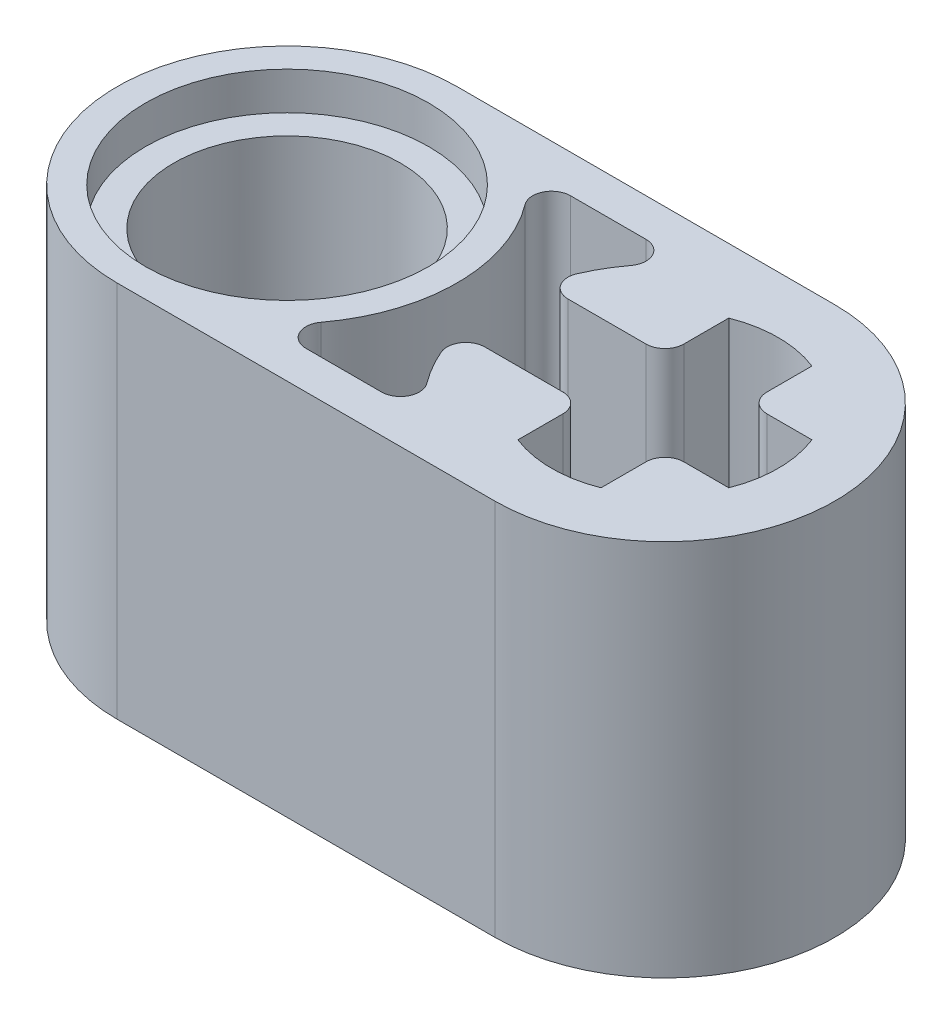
ISO-10303-21;
HEADER;
FILE_DESCRIPTION(('STEP AP214'),'2;1');
FILE_NAME('part.step','',(''),(''),'','','');
FILE_SCHEMA(('AUTOMOTIVE_DESIGN { 1 0 10303 214 1 1 1 1 }'));
ENDSEC;
DATA;
#1=APPLICATION_CONTEXT('core data for automotive mechanical design processes');
#2=APPLICATION_PROTOCOL_DEFINITION('international standard','automotive_design',2000,#1);
#3=PRODUCT_CONTEXT('',#1,'mechanical');
#4=PRODUCT('Part','Part','',(#3));
#5=PRODUCT_RELATED_PRODUCT_CATEGORY('part','',(#4));
#6=PRODUCT_DEFINITION_FORMATION('','',#4);
#7=PRODUCT_DEFINITION_CONTEXT('part definition',#1,'design');
#8=PRODUCT_DEFINITION('design','',#6,#7);
#9=PRODUCT_DEFINITION_SHAPE('','',#8);
#10=(LENGTH_UNIT() NAMED_UNIT(*) SI_UNIT(.MILLI.,.METRE.));
#11=(NAMED_UNIT(*) PLANE_ANGLE_UNIT() SI_UNIT($,.RADIAN.));
#12=(NAMED_UNIT(*) SI_UNIT($,.STERADIAN.) SOLID_ANGLE_UNIT());
#13=UNCERTAINTY_MEASURE_WITH_UNIT(LENGTH_MEASURE(1.E-05),#10,'distance_accuracy_value','');
#14=(GEOMETRIC_REPRESENTATION_CONTEXT(3) GLOBAL_UNCERTAINTY_ASSIGNED_CONTEXT((#13)) GLOBAL_UNIT_ASSIGNED_CONTEXT((#10,
#11,#12)) REPRESENTATION_CONTEXT('',''));
#15=CARTESIAN_POINT('',(0.,0.,0.));
#16=DIRECTION('',(0.,0.,1.));
#17=DIRECTION('',(1.,0.,0.));
#18=AXIS2_PLACEMENT_3D('',#15,#16,#17);
#19=CARTESIAN_POINT('',(-4.,8.,0.));
#20=DIRECTION('',(0.,-1.,0.));
#21=DIRECTION('',(0.,0.,-1.));
#22=AXIS2_PLACEMENT_3D('',#19,#20,#21);
#23=CYLINDRICAL_SURFACE('',#22,2.4);
#24=CARTESIAN_POINT('',(-4.,7.2,0.));
#25=DIRECTION('',(0.,1.,0.));
#26=DIRECTION('',(0.,0.,1.));
#27=AXIS2_PLACEMENT_3D('',#24,#25,#26);
#28=CIRCLE('',#27,2.4);
#29=CARTESIAN_POINT('',(-4.,7.2,2.4));
#30=VERTEX_POINT('',#29);
#31=EDGE_CURVE('E340',#30,#30,#28,.T.);
#32=ORIENTED_EDGE('',*,*,#31,.T.);
#33=EDGE_LOOP('',(#32));
#34=FACE_BOUND('',#33,.T.);
#35=CARTESIAN_POINT('',(-4.,0.8,0.));
#36=DIRECTION('',(0.,-1.,0.));
#37=DIRECTION('',(0.,0.,-1.));
#38=AXIS2_PLACEMENT_3D('',#35,#36,#37);
#39=CIRCLE('',#38,2.4);
#40=CARTESIAN_POINT('',(-4.,0.8,-2.4));
#41=VERTEX_POINT('',#40);
#42=EDGE_CURVE('E42',#41,#41,#39,.T.);
#43=ORIENTED_EDGE('',*,*,#42,.T.);
#44=EDGE_LOOP('',(#43));
#45=FACE_BOUND('',#44,.T.);
#46=ADVANCED_FACE('F38',(#34,#45),#23,.F.);
#47=CARTESIAN_POINT('',(-4.,8.,0.));
#48=DIRECTION('',(0.,1.,0.));
#49=DIRECTION('',(0.,0.,1.));
#50=AXIS2_PLACEMENT_3D('',#47,#48,#49);
#51=PLANE('',#50);
#52=CARTESIAN_POINT('',(-4.,8.,0.));
#53=DIRECTION('',(0.,1.,0.));
#54=DIRECTION('',(0.,0.,1.));
#55=AXIS2_PLACEMENT_3D('',#52,#53,#54);
#56=CIRCLE('',#55,3.);
#57=CARTESIAN_POINT('',(-4.,8.,3.));
#58=VERTEX_POINT('',#57);
#59=EDGE_CURVE('E554',#58,#58,#56,.T.);
#60=ORIENTED_EDGE('',*,*,#59,.F.);
#61=EDGE_LOOP('',(#60));
#62=FACE_BOUND('',#61,.T.);
#63=CARTESIAN_POINT('',(-4.,8.,0.));
#64=DIRECTION('',(0.,1.,0.));
#65=DIRECTION('',(0.,0.,1.));
#66=AXIS2_PLACEMENT_3D('',#63,#64,#65);
#67=CIRCLE('',#66,3.6);
#68=CARTESIAN_POINT('',(-4.,8.,-3.6));
#69=VERTEX_POINT('',#68);
#70=CARTESIAN_POINT('',(-4.,8.,3.6));
#71=VERTEX_POINT('',#70);
#72=EDGE_CURVE('E512',#69,#71,#67,.T.);
#73=ORIENTED_EDGE('',*,*,#72,.T.);
#74=DIRECTION('',(1.,0.,0.));
#75=VECTOR('',#74,1.);
#76=CARTESIAN_POINT('',(-4.,8.,3.6));
#77=LINE('',#76,#75);
#78=CARTESIAN_POINT('',(4.,8.,3.6));
#79=VERTEX_POINT('',#78);
#80=EDGE_CURVE('E516',#71,#79,#77,.T.);
#81=ORIENTED_EDGE('',*,*,#80,.T.);
#82=CARTESIAN_POINT('',(4.,8.,0.));
#83=DIRECTION('',(0.,1.,0.));
#84=DIRECTION('',(0.,0.,1.));
#85=AXIS2_PLACEMENT_3D('',#82,#83,#84);
#86=CIRCLE('',#85,3.6);
#87=CARTESIAN_POINT('',(4.,8.,-3.6));
#88=VERTEX_POINT('',#87);
#89=EDGE_CURVE('E520',#79,#88,#86,.T.);
#90=ORIENTED_EDGE('',*,*,#89,.T.);
#91=DIRECTION('',(-1.,0.,0.));
#92=VECTOR('',#91,1.);
#93=CARTESIAN_POINT('',(-4.,8.,-3.6));
#94=LINE('',#93,#92);
#95=EDGE_CURVE('E523',#88,#69,#94,.T.);
#96=ORIENTED_EDGE('',*,*,#95,.T.);
#97=EDGE_LOOP('',(#73,#81,#90,#96));
#98=FACE_BOUND('',#97,.T.);
#99=DIRECTION('',(0.,0.,1.));
#100=VECTOR('',#99,1.);
#101=CARTESIAN_POINT('',(3.12,8.,-2.23284571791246));
#102=LINE('',#101,#100);
#103=CARTESIAN_POINT('',(3.12,8.,-2.23284571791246));
#104=VERTEX_POINT('',#103);
#105=CARTESIAN_POINT('',(3.12,8.,-1.28));
#106=VERTEX_POINT('',#105);
#107=EDGE_CURVE('E247',#104,#106,#102,.T.);
#108=ORIENTED_EDGE('',*,*,#107,.F.);
#109=CARTESIAN_POINT('',(4.,8.,0.));
#110=DIRECTION('',(0.,1.,0.));
#111=DIRECTION('',(0.,0.,1.));
#112=AXIS2_PLACEMENT_3D('',#109,#110,#111);
#113=CIRCLE('',#112,2.4);
#114=CARTESIAN_POINT('',(4.88,8.,-2.23284571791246));
#115=VERTEX_POINT('',#114);
#116=EDGE_CURVE('E238',#115,#104,#113,.T.);
#117=ORIENTED_EDGE('',*,*,#116,.F.);
#118=DIRECTION('',(0.,0.,-1.));
#119=VECTOR('',#118,1.);
#120=CARTESIAN_POINT('',(4.88,8.,-1.28));
#121=LINE('',#120,#119);
#122=CARTESIAN_POINT('',(4.88,8.,-1.28));
#123=VERTEX_POINT('',#122);
#124=EDGE_CURVE('E335',#123,#115,#121,.T.);
#125=ORIENTED_EDGE('',*,*,#124,.F.);
#126=CARTESIAN_POINT('',(5.28,8.,-1.28));
#127=DIRECTION('',(0.,-1.,0.));
#128=DIRECTION('',(0.,0.,-1.));
#129=AXIS2_PLACEMENT_3D('',#126,#127,#128);
#130=CIRCLE('',#129,0.4);
#131=CARTESIAN_POINT('',(5.28,8.,-0.88));
#132=VERTEX_POINT('',#131);
#133=EDGE_CURVE('E332',#132,#123,#130,.T.);
#134=ORIENTED_EDGE('',*,*,#133,.F.);
#135=DIRECTION('',(-1.,0.,0.));
#136=VECTOR('',#135,1.);
#137=CARTESIAN_POINT('',(6.23284571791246,8.,-0.880000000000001));
#138=LINE('',#137,#136);
#139=CARTESIAN_POINT('',(6.23284571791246,8.,-0.880000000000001));
#140=VERTEX_POINT('',#139);
#141=EDGE_CURVE('E329',#140,#132,#138,.T.);
#142=ORIENTED_EDGE('',*,*,#141,.F.);
#143=CARTESIAN_POINT('',(4.,8.,0.));
#144=DIRECTION('',(0.,1.,0.));
#145=DIRECTION('',(0.,0.,1.));
#146=AXIS2_PLACEMENT_3D('',#143,#144,#145);
#147=CIRCLE('',#146,2.4);
#148=CARTESIAN_POINT('',(6.23284571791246,8.,0.88));
#149=VERTEX_POINT('',#148);
#150=EDGE_CURVE('E326',#149,#140,#147,.T.);
#151=ORIENTED_EDGE('',*,*,#150,.F.);
#152=DIRECTION('',(1.,0.,0.));
#153=VECTOR('',#152,1.);
#154=CARTESIAN_POINT('',(5.28,8.,0.88));
#155=LINE('',#154,#153);
#156=CARTESIAN_POINT('',(5.28,8.,0.88));
#157=VERTEX_POINT('',#156);
#158=EDGE_CURVE('E323',#157,#149,#155,.T.);
#159=ORIENTED_EDGE('',*,*,#158,.F.);
#160=CARTESIAN_POINT('',(5.28,8.,1.28));
#161=DIRECTION('',(0.,-1.,0.));
#162=DIRECTION('',(0.,0.,1.));
#163=AXIS2_PLACEMENT_3D('',#160,#161,#162);
#164=CIRCLE('',#163,0.400000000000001);
#165=CARTESIAN_POINT('',(4.88,8.,1.28));
#166=VERTEX_POINT('',#165);
#167=EDGE_CURVE('E320',#166,#157,#164,.T.);
#168=ORIENTED_EDGE('',*,*,#167,.F.);
#169=DIRECTION('',(0.,0.,-1.));
#170=VECTOR('',#169,1.);
#171=CARTESIAN_POINT('',(4.88,8.,2.23284571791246));
#172=LINE('',#171,#170);
#173=CARTESIAN_POINT('',(4.88,8.,2.23284571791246));
#174=VERTEX_POINT('',#173);
#175=EDGE_CURVE('E317',#174,#166,#172,.T.);
#176=ORIENTED_EDGE('',*,*,#175,.F.);
#177=CARTESIAN_POINT('',(4.,8.,0.));
#178=DIRECTION('',(0.,1.,0.));
#179=DIRECTION('',(0.,0.,1.));
#180=AXIS2_PLACEMENT_3D('',#177,#178,#179);
#181=CIRCLE('',#180,2.4);
#182=CARTESIAN_POINT('',(3.12,8.,2.23284571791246));
#183=VERTEX_POINT('',#182);
#184=EDGE_CURVE('E314',#183,#174,#181,.T.);
#185=ORIENTED_EDGE('',*,*,#184,.F.);
#186=DIRECTION('',(0.,0.,1.));
#187=VECTOR('',#186,1.);
#188=CARTESIAN_POINT('',(3.12,8.,1.28));
#189=LINE('',#188,#187);
#190=CARTESIAN_POINT('',(3.12,8.,1.28));
#191=VERTEX_POINT('',#190);
#192=EDGE_CURVE('E311',#191,#183,#189,.T.);
#193=ORIENTED_EDGE('',*,*,#192,.F.);
#194=CARTESIAN_POINT('',(2.72,8.,1.28));
#195=DIRECTION('',(0.,-1.,0.));
#196=DIRECTION('',(0.,0.,-1.));
#197=AXIS2_PLACEMENT_3D('',#194,#195,#196);
#198=CIRCLE('',#197,0.4);
#199=CARTESIAN_POINT('',(2.72,8.,0.88));
#200=VERTEX_POINT('',#199);
#201=EDGE_CURVE('E308',#200,#191,#198,.T.);
#202=ORIENTED_EDGE('',*,*,#201,.F.);
#203=DIRECTION('',(1.,0.,0.));
#204=VECTOR('',#203,1.);
#205=CARTESIAN_POINT('',(1.76715428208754,8.,0.88));
#206=LINE('',#205,#204);
#207=CARTESIAN_POINT('',(1.06715155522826,8.,0.88));
#208=VERTEX_POINT('',#207);
#209=EDGE_CURVE('E305',#208,#200,#206,.T.);
#210=ORIENTED_EDGE('',*,*,#209,.F.);
#211=CARTESIAN_POINT('',(1.06715155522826,8.,1.28));
#212=DIRECTION('',(0.,-1.,0.));
#213=DIRECTION('',(0.,0.,1.));
#214=AXIS2_PLACEMENT_3D('',#211,#212,#213);
#215=CIRCLE('',#214,0.400000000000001);
#216=CARTESIAN_POINT('',(0.700545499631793,8.,1.44));
#217=VERTEX_POINT('',#216);
#218=EDGE_CURVE('E302',#217,#208,#215,.T.);
#219=ORIENTED_EDGE('',*,*,#218,.F.);
#220=CARTESIAN_POINT('',(4.,8.,0.));
#221=DIRECTION('',(0.,-1.,0.));
#222=DIRECTION('',(0.,0.,1.));
#223=AXIS2_PLACEMENT_3D('',#220,#221,#222);
#224=CIRCLE('',#223,3.6);
#225=CARTESIAN_POINT('',(1.12,8.,2.16));
#226=VERTEX_POINT('',#225);
#227=EDGE_CURVE('E299',#226,#217,#224,.T.);
#228=ORIENTED_EDGE('',*,*,#227,.F.);
#229=CARTESIAN_POINT('',(0.799999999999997,8.,2.4));
#230=DIRECTION('',(0.,1.,0.));
#231=DIRECTION('',(0.,0.,1.));
#232=AXIS2_PLACEMENT_3D('',#229,#230,#231);
#233=CIRCLE('',#232,0.4);
#234=CARTESIAN_POINT('',(0.799999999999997,8.,2.8));
#235=VERTEX_POINT('',#234);
#236=EDGE_CURVE('E296',#235,#226,#233,.T.);
#237=ORIENTED_EDGE('',*,*,#236,.F.);
#238=DIRECTION('',(1.,0.,0.));
#239=VECTOR('',#238,1.);
#240=CARTESIAN_POINT('',(-0.8,8.,2.8));
#241=LINE('',#240,#239);
#242=CARTESIAN_POINT('',(-0.8,8.,2.8));
#243=VERTEX_POINT('',#242);
#244=EDGE_CURVE('E293',#243,#235,#241,.T.);
#245=ORIENTED_EDGE('',*,*,#244,.F.);
#246=CARTESIAN_POINT('',(-0.8,8.,2.4));
#247=DIRECTION('',(0.,1.,0.));
#248=DIRECTION('',(0.,0.,-1.));
#249=AXIS2_PLACEMENT_3D('',#246,#247,#248);
#250=CIRCLE('',#249,0.4);
#251=CARTESIAN_POINT('',(-1.12,8.,2.16));
#252=VERTEX_POINT('',#251);
#253=EDGE_CURVE('E290',#252,#243,#250,.T.);
#254=ORIENTED_EDGE('',*,*,#253,.F.);
#255=CARTESIAN_POINT('',(-4.,8.,0.));
#256=DIRECTION('',(0.,-1.,0.));
#257=DIRECTION('',(0.,0.,1.));
#258=AXIS2_PLACEMENT_3D('',#255,#256,#257);
#259=CIRCLE('',#258,3.6);
#260=CARTESIAN_POINT('',(-1.12,8.,-2.16));
#261=VERTEX_POINT('',#260);
#262=EDGE_CURVE('E287',#261,#252,#259,.T.);
#263=ORIENTED_EDGE('',*,*,#262,.F.);
#264=CARTESIAN_POINT('',(-0.8,8.,-2.4));
#265=DIRECTION('',(0.,1.,0.));
#266=DIRECTION('',(0.,0.,1.));
#267=AXIS2_PLACEMENT_3D('',#264,#265,#266);
#268=CIRCLE('',#267,0.4);
#269=CARTESIAN_POINT('',(-0.8,8.,-2.8));
#270=VERTEX_POINT('',#269);
#271=EDGE_CURVE('E284',#270,#261,#268,.T.);
#272=ORIENTED_EDGE('',*,*,#271,.F.);
#273=DIRECTION('',(-1.,0.,0.));
#274=VECTOR('',#273,1.);
#275=CARTESIAN_POINT('',(-0.8,8.,-2.8));
#276=LINE('',#275,#274);
#277=CARTESIAN_POINT('',(0.799999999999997,8.,-2.8));
#278=VERTEX_POINT('',#277);
#279=EDGE_CURVE('E281',#278,#270,#276,.T.);
#280=ORIENTED_EDGE('',*,*,#279,.F.);
#281=CARTESIAN_POINT('',(0.799999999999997,8.,-2.4));
#282=DIRECTION('',(0.,1.,0.));
#283=DIRECTION('',(0.,0.,-1.));
#284=AXIS2_PLACEMENT_3D('',#281,#282,#283);
#285=CIRCLE('',#284,0.4);
#286=CARTESIAN_POINT('',(1.12,8.,-2.16));
#287=VERTEX_POINT('',#286);
#288=EDGE_CURVE('E278',#287,#278,#285,.T.);
#289=ORIENTED_EDGE('',*,*,#288,.F.);
#290=CARTESIAN_POINT('',(4.,8.,0.));
#291=DIRECTION('',(0.,-1.,0.));
#292=DIRECTION('',(0.,0.,1.));
#293=AXIS2_PLACEMENT_3D('',#290,#291,#292);
#294=CIRCLE('',#293,3.6);
#295=CARTESIAN_POINT('',(0.700545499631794,8.,-1.44));
#296=VERTEX_POINT('',#295);
#297=EDGE_CURVE('E275',#296,#287,#294,.T.);
#298=ORIENTED_EDGE('',*,*,#297,.F.);
#299=CARTESIAN_POINT('',(1.06715155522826,8.,-1.28));
#300=DIRECTION('',(0.,-1.,0.));
#301=DIRECTION('',(0.,0.,-1.));
#302=AXIS2_PLACEMENT_3D('',#299,#300,#301);
#303=CIRCLE('',#302,0.4);
#304=CARTESIAN_POINT('',(1.06715155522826,8.,-0.88));
#305=VERTEX_POINT('',#304);
#306=EDGE_CURVE('E272',#305,#296,#303,.T.);
#307=ORIENTED_EDGE('',*,*,#306,.F.);
#308=DIRECTION('',(-1.,0.,0.));
#309=VECTOR('',#308,1.);
#310=CARTESIAN_POINT('',(2.72,8.,-0.88));
#311=LINE('',#310,#309);
#312=CARTESIAN_POINT('',(2.72,8.,-0.88));
#313=VERTEX_POINT('',#312);
#314=EDGE_CURVE('E266',#313,#305,#311,.T.);
#315=ORIENTED_EDGE('',*,*,#314,.F.);
#316=CARTESIAN_POINT('',(2.72,8.,-1.28));
#317=DIRECTION('',(0.,-1.,0.));
#318=DIRECTION('',(0.,0.,-1.));
#319=AXIS2_PLACEMENT_3D('',#316,#317,#318);
#320=CIRCLE('',#319,0.4);
#321=EDGE_CURVE('E262',#106,#313,#320,.T.);
#322=ORIENTED_EDGE('',*,*,#321,.F.);
#323=EDGE_LOOP('',(#108,#117,#125,#134,#142,#151,#159,#168,#176,#185,#193,#202,#210,#219,#228,
#237,#245,#254,#263,#272,#280,#289,#298,#307,#315,#322));
#324=FACE_BOUND('',#323,.T.);
#325=ADVANCED_FACE('F260',(#62,#98,#324),#51,.T.);
#326=CARTESIAN_POINT('',(-4.,0.,0.));
#327=DIRECTION('',(0.,1.,0.));
#328=DIRECTION('',(0.,0.,1.));
#329=AXIS2_PLACEMENT_3D('',#326,#327,#328);
#330=PLANE('',#329);
#331=CARTESIAN_POINT('',(-4.,0.,0.));
#332=DIRECTION('',(0.,-1.,0.));
#333=DIRECTION('',(0.,0.,-1.));
#334=AXIS2_PLACEMENT_3D('',#331,#332,#333);
#335=CIRCLE('',#334,3.);
#336=CARTESIAN_POINT('',(-4.,0.,-3.));
#337=VERTEX_POINT('',#336);
#338=EDGE_CURVE('E561',#337,#337,#335,.T.);
#339=ORIENTED_EDGE('',*,*,#338,.F.);
#340=EDGE_LOOP('',(#339));
#341=FACE_BOUND('',#340,.T.);
#342=CARTESIAN_POINT('',(-4.,0.,0.));
#343=DIRECTION('',(0.,1.,0.));
#344=DIRECTION('',(0.,0.,1.));
#345=AXIS2_PLACEMENT_3D('',#342,#343,#344);
#346=CIRCLE('',#345,3.6);
#347=CARTESIAN_POINT('',(-4.,0.,-3.6));
#348=VERTEX_POINT('',#347);
#349=CARTESIAN_POINT('',(-4.,0.,3.6));
#350=VERTEX_POINT('',#349);
#351=EDGE_CURVE('E256',#348,#350,#346,.T.);
#352=ORIENTED_EDGE('',*,*,#351,.F.);
#353=DIRECTION('',(-1.,0.,0.));
#354=VECTOR('',#353,1.);
#355=CARTESIAN_POINT('',(-4.,0.,-3.6));
#356=LINE('',#355,#354);
#357=CARTESIAN_POINT('',(4.,0.,-3.6));
#358=VERTEX_POINT('',#357);
#359=EDGE_CURVE('E517',#358,#348,#356,.T.);
#360=ORIENTED_EDGE('',*,*,#359,.F.);
#361=CARTESIAN_POINT('',(4.,0.,0.));
#362=DIRECTION('',(0.,1.,0.));
#363=DIRECTION('',(0.,0.,1.));
#364=AXIS2_PLACEMENT_3D('',#361,#362,#363);
#365=CIRCLE('',#364,3.6);
#366=CARTESIAN_POINT('',(4.,0.,3.6));
#367=VERTEX_POINT('',#366);
#368=EDGE_CURVE('E533',#367,#358,#365,.T.);
#369=ORIENTED_EDGE('',*,*,#368,.F.);
#370=DIRECTION('',(1.,0.,0.));
#371=VECTOR('',#370,1.);
#372=CARTESIAN_POINT('',(-4.,0.,3.6));
#373=LINE('',#372,#371);
#374=EDGE_CURVE('E530',#350,#367,#373,.T.);
#375=ORIENTED_EDGE('',*,*,#374,.F.);
#376=EDGE_LOOP('',(#352,#360,#369,#375));
#377=FACE_BOUND('',#376,.T.);
#378=CARTESIAN_POINT('',(4.,0.,0.));
#379=DIRECTION('',(0.,1.,0.));
#380=DIRECTION('',(0.,0.,1.));
#381=AXIS2_PLACEMENT_3D('',#378,#379,#380);
#382=CIRCLE('',#381,2.4);
#383=CARTESIAN_POINT('',(4.88,0.,-2.23284571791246));
#384=VERTEX_POINT('',#383);
#385=CARTESIAN_POINT('',(3.12,0.,-2.23284571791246));
#386=VERTEX_POINT('',#385);
#387=EDGE_CURVE('E64',#384,#386,#382,.T.);
#388=ORIENTED_EDGE('',*,*,#387,.T.);
#389=DIRECTION('',(0.,0.,1.));
#390=VECTOR('',#389,1.);
#391=CARTESIAN_POINT('',(3.12,0.,-2.23284571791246));
#392=LINE('',#391,#390);
#393=CARTESIAN_POINT('',(3.12,0.,-1.28));
#394=VERTEX_POINT('',#393);
#395=EDGE_CURVE('E254',#386,#394,#392,.T.);
#396=ORIENTED_EDGE('',*,*,#395,.T.);
#397=CARTESIAN_POINT('',(2.72,0.,-1.28));
#398=DIRECTION('',(0.,-1.,0.));
#399=DIRECTION('',(0.,0.,-1.));
#400=AXIS2_PLACEMENT_3D('',#397,#398,#399);
#401=CIRCLE('',#400,0.4);
#402=CARTESIAN_POINT('',(2.72,0.,-0.88));
#403=VERTEX_POINT('',#402);
#404=EDGE_CURVE('E343',#394,#403,#401,.T.);
#405=ORIENTED_EDGE('',*,*,#404,.T.);
#406=DIRECTION('',(-1.,0.,0.));
#407=VECTOR('',#406,1.);
#408=CARTESIAN_POINT('',(1.76715428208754,0.,-0.88));
#409=LINE('',#408,#407);
#410=CARTESIAN_POINT('',(1.06715155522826,0.,-0.88));
#411=VERTEX_POINT('',#410);
#412=EDGE_CURVE('E347',#403,#411,#409,.T.);
#413=ORIENTED_EDGE('',*,*,#412,.T.);
#414=CARTESIAN_POINT('',(1.06715155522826,0.,-1.28));
#415=DIRECTION('',(0.,-1.,0.));
#416=DIRECTION('',(0.,0.,-1.));
#417=AXIS2_PLACEMENT_3D('',#414,#415,#416);
#418=CIRCLE('',#417,0.4);
#419=CARTESIAN_POINT('',(0.700545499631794,0.,-1.44));
#420=VERTEX_POINT('',#419);
#421=EDGE_CURVE('E351',#411,#420,#418,.T.);
#422=ORIENTED_EDGE('',*,*,#421,.T.);
#423=CARTESIAN_POINT('',(4.,0.,0.));
#424=DIRECTION('',(0.,-1.,0.));
#425=DIRECTION('',(0.,0.,1.));
#426=AXIS2_PLACEMENT_3D('',#423,#424,#425);
#427=CIRCLE('',#426,3.6);
#428=CARTESIAN_POINT('',(1.12,0.,-2.16));
#429=VERTEX_POINT('',#428);
#430=EDGE_CURVE('E355',#420,#429,#427,.T.);
#431=ORIENTED_EDGE('',*,*,#430,.T.);
#432=CARTESIAN_POINT('',(0.799999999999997,0.,-2.4));
#433=DIRECTION('',(0.,1.,0.));
#434=DIRECTION('',(0.,0.,-1.));
#435=AXIS2_PLACEMENT_3D('',#432,#433,#434);
#436=CIRCLE('',#435,0.4);
#437=CARTESIAN_POINT('',(0.799999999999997,0.,-2.8));
#438=VERTEX_POINT('',#437);
#439=EDGE_CURVE('E359',#429,#438,#436,.T.);
#440=ORIENTED_EDGE('',*,*,#439,.T.);
#441=DIRECTION('',(-1.,0.,0.));
#442=VECTOR('',#441,1.);
#443=CARTESIAN_POINT('',(-0.8,0.,-2.8));
#444=LINE('',#443,#442);
#445=CARTESIAN_POINT('',(-0.8,0.,-2.8));
#446=VERTEX_POINT('',#445);
#447=EDGE_CURVE('E363',#438,#446,#444,.T.);
#448=ORIENTED_EDGE('',*,*,#447,.T.);
#449=CARTESIAN_POINT('',(-0.8,0.,-2.4));
#450=DIRECTION('',(0.,1.,0.));
#451=DIRECTION('',(0.,0.,1.));
#452=AXIS2_PLACEMENT_3D('',#449,#450,#451);
#453=CIRCLE('',#452,0.4);
#454=CARTESIAN_POINT('',(-1.12,0.,-2.16));
#455=VERTEX_POINT('',#454);
#456=EDGE_CURVE('E367',#446,#455,#453,.T.);
#457=ORIENTED_EDGE('',*,*,#456,.T.);
#458=CARTESIAN_POINT('',(-4.,0.,0.));
#459=DIRECTION('',(0.,-1.,0.));
#460=DIRECTION('',(0.,0.,1.));
#461=AXIS2_PLACEMENT_3D('',#458,#459,#460);
#462=CIRCLE('',#461,3.6);
#463=CARTESIAN_POINT('',(-1.12,0.,2.16));
#464=VERTEX_POINT('',#463);
#465=EDGE_CURVE('E371',#455,#464,#462,.T.);
#466=ORIENTED_EDGE('',*,*,#465,.T.);
#467=CARTESIAN_POINT('',(-0.8,0.,2.4));
#468=DIRECTION('',(0.,1.,0.));
#469=DIRECTION('',(0.,0.,-1.));
#470=AXIS2_PLACEMENT_3D('',#467,#468,#469);
#471=CIRCLE('',#470,0.4);
#472=CARTESIAN_POINT('',(-0.8,0.,2.8));
#473=VERTEX_POINT('',#472);
#474=EDGE_CURVE('E375',#464,#473,#471,.T.);
#475=ORIENTED_EDGE('',*,*,#474,.T.);
#476=DIRECTION('',(1.,0.,0.));
#477=VECTOR('',#476,1.);
#478=CARTESIAN_POINT('',(-0.8,0.,2.8));
#479=LINE('',#478,#477);
#480=CARTESIAN_POINT('',(0.799999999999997,0.,2.8));
#481=VERTEX_POINT('',#480);
#482=EDGE_CURVE('E379',#473,#481,#479,.T.);
#483=ORIENTED_EDGE('',*,*,#482,.T.);
#484=CARTESIAN_POINT('',(0.799999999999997,0.,2.4));
#485=DIRECTION('',(0.,1.,0.));
#486=DIRECTION('',(0.,0.,1.));
#487=AXIS2_PLACEMENT_3D('',#484,#485,#486);
#488=CIRCLE('',#487,0.4);
#489=CARTESIAN_POINT('',(1.12,0.,2.16));
#490=VERTEX_POINT('',#489);
#491=EDGE_CURVE('E383',#481,#490,#488,.T.);
#492=ORIENTED_EDGE('',*,*,#491,.T.);
#493=CARTESIAN_POINT('',(4.,0.,0.));
#494=DIRECTION('',(0.,-1.,0.));
#495=DIRECTION('',(0.,0.,1.));
#496=AXIS2_PLACEMENT_3D('',#493,#494,#495);
#497=CIRCLE('',#496,3.6);
#498=CARTESIAN_POINT('',(0.700545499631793,0.,1.44));
#499=VERTEX_POINT('',#498);
#500=EDGE_CURVE('E387',#490,#499,#497,.T.);
#501=ORIENTED_EDGE('',*,*,#500,.T.);
#502=CARTESIAN_POINT('',(1.06715155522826,0.,1.28));
#503=DIRECTION('',(0.,-1.,0.));
#504=DIRECTION('',(0.,0.,1.));
#505=AXIS2_PLACEMENT_3D('',#502,#503,#504);
#506=CIRCLE('',#505,0.400000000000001);
#507=CARTESIAN_POINT('',(1.06715155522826,0.,0.88));
#508=VERTEX_POINT('',#507);
#509=EDGE_CURVE('E391',#499,#508,#506,.T.);
#510=ORIENTED_EDGE('',*,*,#509,.T.);
#511=DIRECTION('',(1.,0.,0.));
#512=VECTOR('',#511,1.);
#513=CARTESIAN_POINT('',(1.76715428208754,0.,0.88));
#514=LINE('',#513,#512);
#515=CARTESIAN_POINT('',(2.72,0.,0.88));
#516=VERTEX_POINT('',#515);
#517=EDGE_CURVE('E395',#508,#516,#514,.T.);
#518=ORIENTED_EDGE('',*,*,#517,.T.);
#519=CARTESIAN_POINT('',(2.72,0.,1.28));
#520=DIRECTION('',(0.,-1.,0.));
#521=DIRECTION('',(0.,0.,-1.));
#522=AXIS2_PLACEMENT_3D('',#519,#520,#521);
#523=CIRCLE('',#522,0.4);
#524=CARTESIAN_POINT('',(3.12,0.,1.28));
#525=VERTEX_POINT('',#524);
#526=EDGE_CURVE('E399',#516,#525,#523,.T.);
#527=ORIENTED_EDGE('',*,*,#526,.T.);
#528=DIRECTION('',(0.,0.,1.));
#529=VECTOR('',#528,1.);
#530=CARTESIAN_POINT('',(3.12,0.,1.28));
#531=LINE('',#530,#529);
#532=CARTESIAN_POINT('',(3.12,0.,2.23284571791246));
#533=VERTEX_POINT('',#532);
#534=EDGE_CURVE('E403',#525,#533,#531,.T.);
#535=ORIENTED_EDGE('',*,*,#534,.T.);
#536=CARTESIAN_POINT('',(4.,0.,0.));
#537=DIRECTION('',(0.,1.,0.));
#538=DIRECTION('',(0.,0.,1.));
#539=AXIS2_PLACEMENT_3D('',#536,#537,#538);
#540=CIRCLE('',#539,2.4);
#541=CARTESIAN_POINT('',(4.88,0.,2.23284571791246));
#542=VERTEX_POINT('',#541);
#543=EDGE_CURVE('E407',#533,#542,#540,.T.);
#544=ORIENTED_EDGE('',*,*,#543,.T.);
#545=DIRECTION('',(0.,0.,-1.));
#546=VECTOR('',#545,1.);
#547=CARTESIAN_POINT('',(4.88,0.,2.23284571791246));
#548=LINE('',#547,#546);
#549=CARTESIAN_POINT('',(4.88,0.,1.28));
#550=VERTEX_POINT('',#549);
#551=EDGE_CURVE('E411',#542,#550,#548,.T.);
#552=ORIENTED_EDGE('',*,*,#551,.T.);
#553=CARTESIAN_POINT('',(5.28,0.,1.28));
#554=DIRECTION('',(0.,-1.,0.));
#555=DIRECTION('',(0.,0.,1.));
#556=AXIS2_PLACEMENT_3D('',#553,#554,#555);
#557=CIRCLE('',#556,0.400000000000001);
#558=CARTESIAN_POINT('',(5.28,0.,0.88));
#559=VERTEX_POINT('',#558);
#560=EDGE_CURVE('E415',#550,#559,#557,.T.);
#561=ORIENTED_EDGE('',*,*,#560,.T.);
#562=DIRECTION('',(1.,0.,0.));
#563=VECTOR('',#562,1.);
#564=CARTESIAN_POINT('',(5.28,0.,0.88));
#565=LINE('',#564,#563);
#566=CARTESIAN_POINT('',(6.23284571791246,0.,0.88));
#567=VERTEX_POINT('',#566);
#568=EDGE_CURVE('E419',#559,#567,#565,.T.);
#569=ORIENTED_EDGE('',*,*,#568,.T.);
#570=CARTESIAN_POINT('',(4.,0.,0.));
#571=DIRECTION('',(0.,1.,0.));
#572=DIRECTION('',(0.,0.,1.));
#573=AXIS2_PLACEMENT_3D('',#570,#571,#572);
#574=CIRCLE('',#573,2.4);
#575=CARTESIAN_POINT('',(6.23284571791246,0.,-0.880000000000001));
#576=VERTEX_POINT('',#575);
#577=EDGE_CURVE('E423',#567,#576,#574,.T.);
#578=ORIENTED_EDGE('',*,*,#577,.T.);
#579=DIRECTION('',(-1.,0.,0.));
#580=VECTOR('',#579,1.);
#581=CARTESIAN_POINT('',(6.23284571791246,0.,-0.880000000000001));
#582=LINE('',#581,#580);
#583=CARTESIAN_POINT('',(5.28,0.,-0.88));
#584=VERTEX_POINT('',#583);
#585=EDGE_CURVE('E427',#576,#584,#582,.T.);
#586=ORIENTED_EDGE('',*,*,#585,.T.);
#587=CARTESIAN_POINT('',(5.28,0.,-1.28));
#588=DIRECTION('',(0.,-1.,0.));
#589=DIRECTION('',(0.,0.,-1.));
#590=AXIS2_PLACEMENT_3D('',#587,#588,#589);
#591=CIRCLE('',#590,0.4);
#592=CARTESIAN_POINT('',(4.88,0.,-1.28));
#593=VERTEX_POINT('',#592);
#594=EDGE_CURVE('E431',#584,#593,#591,.T.);
#595=ORIENTED_EDGE('',*,*,#594,.T.);
#596=DIRECTION('',(0.,0.,-1.));
#597=VECTOR('',#596,1.);
#598=CARTESIAN_POINT('',(4.88,0.,-1.28));
#599=LINE('',#598,#597);
#600=EDGE_CURVE('E248',#593,#384,#599,.T.);
#601=ORIENTED_EDGE('',*,*,#600,.T.);
#602=EDGE_LOOP('',(#388,#396,#405,#413,#422,#431,#440,#448,#457,#466,#475,#483,#492,#501,#510,
#518,#527,#535,#544,#552,#561,#569,#578,#586,#595,#601));
#603=FACE_BOUND('',#602,.T.);
#604=ADVANCED_FACE('F592',(#341,#377,#603),#330,.F.);
#605=CARTESIAN_POINT('',(-4.,8.,0.));
#606=DIRECTION('',(0.,-1.,0.));
#607=DIRECTION('',(0.,0.,-1.));
#608=AXIS2_PLACEMENT_3D('',#605,#606,#607);
#609=CYLINDRICAL_SURFACE('',#608,3.6);
#610=ORIENTED_EDGE('',*,*,#351,.T.);
#611=DIRECTION('',(0.,-1.,0.));
#612=VECTOR('',#611,1.);
#613=CARTESIAN_POINT('',(-4.,8.,3.6));
#614=LINE('',#613,#612);
#615=EDGE_CURVE('E11',#71,#350,#614,.T.);
#616=ORIENTED_EDGE('',*,*,#615,.F.);
#617=ORIENTED_EDGE('',*,*,#72,.F.);
#618=DIRECTION('',(0.,-1.,0.));
#619=VECTOR('',#618,1.);
#620=CARTESIAN_POINT('',(-4.,8.,-3.6));
#621=LINE('',#620,#619);
#622=EDGE_CURVE('E526',#69,#348,#621,.T.);
#623=ORIENTED_EDGE('',*,*,#622,.T.);
#624=EDGE_LOOP('',(#610,#616,#617,#623));
#625=FACE_BOUND('',#624,.T.);
#626=ADVANCED_FACE('F40',(#625),#609,.T.);
#627=CARTESIAN_POINT('',(-4.,8.,3.6));
#628=DIRECTION('',(0.,0.,-1.));
#629=DIRECTION('',(-1.,0.,0.));
#630=AXIS2_PLACEMENT_3D('',#627,#628,#629);
#631=PLANE('',#630);
#632=ORIENTED_EDGE('',*,*,#374,.T.);
#633=DIRECTION('',(0.,-1.,0.));
#634=VECTOR('',#633,1.);
#635=CARTESIAN_POINT('',(4.,8.,3.6));
#636=LINE('',#635,#634);
#637=EDGE_CURVE('E48',#79,#367,#636,.T.);
#638=ORIENTED_EDGE('',*,*,#637,.F.);
#639=ORIENTED_EDGE('',*,*,#80,.F.);
#640=ORIENTED_EDGE('',*,*,#615,.T.);
#641=EDGE_LOOP('',(#632,#638,#639,#640));
#642=FACE_BOUND('',#641,.T.);
#643=ADVANCED_FACE('F606',(#642),#631,.F.);
#644=CARTESIAN_POINT('',(4.,8.,0.));
#645=DIRECTION('',(0.,-1.,0.));
#646=DIRECTION('',(0.,0.,-1.));
#647=AXIS2_PLACEMENT_3D('',#644,#645,#646);
#648=CYLINDRICAL_SURFACE('',#647,3.6);
#649=ORIENTED_EDGE('',*,*,#368,.T.);
#650=DIRECTION('',(0.,-1.,0.));
#651=VECTOR('',#650,1.);
#652=CARTESIAN_POINT('',(4.,8.,-3.6));
#653=LINE('',#652,#651);
#654=EDGE_CURVE('E541',#88,#358,#653,.T.);
#655=ORIENTED_EDGE('',*,*,#654,.F.);
#656=ORIENTED_EDGE('',*,*,#89,.F.);
#657=ORIENTED_EDGE('',*,*,#637,.T.);
#658=EDGE_LOOP('',(#649,#655,#656,#657));
#659=FACE_BOUND('',#658,.T.);
#660=ADVANCED_FACE('F603',(#659),#648,.T.);
#661=CARTESIAN_POINT('',(-4.,8.,-3.6));
#662=DIRECTION('',(0.,0.,1.));
#663=DIRECTION('',(1.,0.,0.));
#664=AXIS2_PLACEMENT_3D('',#661,#662,#663);
#665=PLANE('',#664);
#666=ORIENTED_EDGE('',*,*,#359,.T.);
#667=ORIENTED_EDGE('',*,*,#622,.F.);
#668=ORIENTED_EDGE('',*,*,#95,.F.);
#669=ORIENTED_EDGE('',*,*,#654,.T.);
#670=EDGE_LOOP('',(#666,#667,#668,#669));
#671=FACE_BOUND('',#670,.T.);
#672=ADVANCED_FACE('F600',(#671),#665,.F.);
#673=CARTESIAN_POINT('',(4.,8.,0.));
#674=DIRECTION('',(0.,-1.,0.));
#675=DIRECTION('',(0.,0.,-1.));
#676=AXIS2_PLACEMENT_3D('',#673,#674,#675);
#677=CYLINDRICAL_SURFACE('',#676,2.4);
#678=ORIENTED_EDGE('',*,*,#387,.F.);
#679=DIRECTION('',(0.,-1.,0.));
#680=VECTOR('',#679,1.);
#681=CARTESIAN_POINT('',(4.88,8.,-2.23284571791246));
#682=LINE('',#681,#680);
#683=EDGE_CURVE('E242',#115,#384,#682,.T.);
#684=ORIENTED_EDGE('',*,*,#683,.F.);
#685=ORIENTED_EDGE('',*,*,#116,.T.);
#686=DIRECTION('',(0.,-1.,0.));
#687=VECTOR('',#686,1.);
#688=CARTESIAN_POINT('',(3.12,8.,-2.23284571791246));
#689=LINE('',#688,#687);
#690=EDGE_CURVE('E241',#104,#386,#689,.T.);
#691=ORIENTED_EDGE('',*,*,#690,.T.);
#692=EDGE_LOOP('',(#678,#684,#685,#691));
#693=FACE_BOUND('',#692,.T.);
#694=ADVANCED_FACE('F240',(#693),#677,.F.);
#695=CARTESIAN_POINT('',(3.12,8.,-2.23284571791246));
#696=DIRECTION('',(1.,0.,0.));
#697=DIRECTION('',(0.,0.,-1.));
#698=AXIS2_PLACEMENT_3D('',#695,#696,#697);
#699=PLANE('',#698);
#700=ORIENTED_EDGE('',*,*,#395,.F.);
#701=ORIENTED_EDGE('',*,*,#690,.F.);
#702=ORIENTED_EDGE('',*,*,#107,.T.);
#703=DIRECTION('',(0.,-1.,0.));
#704=VECTOR('',#703,1.);
#705=CARTESIAN_POINT('',(3.12,8.,-1.28));
#706=LINE('',#705,#704);
#707=EDGE_CURVE('E257',#106,#394,#706,.T.);
#708=ORIENTED_EDGE('',*,*,#707,.T.);
#709=EDGE_LOOP('',(#700,#701,#702,#708));
#710=FACE_BOUND('',#709,.T.);
#711=ADVANCED_FACE('F251',(#710),#699,.T.);
#712=CARTESIAN_POINT('',(2.72,8.,-1.28));
#713=DIRECTION('',(0.,-1.,0.));
#714=DIRECTION('',(0.,0.,-1.));
#715=AXIS2_PLACEMENT_3D('',#712,#713,#714);
#716=CYLINDRICAL_SURFACE('',#715,0.4);
#717=ORIENTED_EDGE('',*,*,#404,.F.);
#718=ORIENTED_EDGE('',*,*,#707,.F.);
#719=ORIENTED_EDGE('',*,*,#321,.T.);
#720=DIRECTION('',(0.,-1.,0.));
#721=VECTOR('',#720,1.);
#722=CARTESIAN_POINT('',(2.72,8.,-0.88));
#723=LINE('',#722,#721);
#724=EDGE_CURVE('E506',#313,#403,#723,.T.);
#725=ORIENTED_EDGE('',*,*,#724,.T.);
#726=EDGE_LOOP('',(#717,#718,#719,#725));
#727=FACE_BOUND('',#726,.T.);
#728=ADVANCED_FACE('F737',(#727),#716,.T.);
#729=CARTESIAN_POINT('',(1.76715428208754,8.,-0.88));
#730=DIRECTION('',(0.,0.,1.));
#731=DIRECTION('',(1.,0.,0.));
#732=AXIS2_PLACEMENT_3D('',#729,#730,#731);
#733=PLANE('',#732);
#734=ORIENTED_EDGE('',*,*,#412,.F.);
#735=ORIENTED_EDGE('',*,*,#724,.F.);
#736=ORIENTED_EDGE('',*,*,#314,.T.);
#737=DIRECTION('',(0.,-1.,0.));
#738=VECTOR('',#737,1.);
#739=CARTESIAN_POINT('',(1.06715155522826,8.,-0.88));
#740=LINE('',#739,#738);
#741=EDGE_CURVE('E503',#305,#411,#740,.T.);
#742=ORIENTED_EDGE('',*,*,#741,.T.);
#743=EDGE_LOOP('',(#734,#735,#736,#742));
#744=FACE_BOUND('',#743,.T.);
#745=ADVANCED_FACE('F734',(#744),#733,.T.);
#746=CARTESIAN_POINT('',(1.06715155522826,8.,-1.28));
#747=DIRECTION('',(0.,-1.,0.));
#748=DIRECTION('',(0.,0.,-1.));
#749=AXIS2_PLACEMENT_3D('',#746,#747,#748);
#750=CYLINDRICAL_SURFACE('',#749,0.4);
#751=ORIENTED_EDGE('',*,*,#421,.F.);
#752=ORIENTED_EDGE('',*,*,#741,.F.);
#753=ORIENTED_EDGE('',*,*,#306,.T.);
#754=DIRECTION('',(0.,-1.,0.));
#755=VECTOR('',#754,1.);
#756=CARTESIAN_POINT('',(0.700545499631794,8.,-1.44));
#757=LINE('',#756,#755);
#758=EDGE_CURVE('E500',#296,#420,#757,.T.);
#759=ORIENTED_EDGE('',*,*,#758,.T.);
#760=EDGE_LOOP('',(#751,#752,#753,#759));
#761=FACE_BOUND('',#760,.T.);
#762=ADVANCED_FACE('F730',(#761),#750,.T.);
#763=CARTESIAN_POINT('',(4.,8.,0.));
#764=DIRECTION('',(0.,-1.,0.));
#765=DIRECTION('',(0.,0.,-1.));
#766=AXIS2_PLACEMENT_3D('',#763,#764,#765);
#767=CYLINDRICAL_SURFACE('',#766,3.6);
#768=ORIENTED_EDGE('',*,*,#430,.F.);
#769=ORIENTED_EDGE('',*,*,#758,.F.);
#770=ORIENTED_EDGE('',*,*,#297,.T.);
#771=DIRECTION('',(0.,-1.,0.));
#772=VECTOR('',#771,1.);
#773=CARTESIAN_POINT('',(1.12,8.,-2.16));
#774=LINE('',#773,#772);
#775=EDGE_CURVE('E497',#287,#429,#774,.T.);
#776=ORIENTED_EDGE('',*,*,#775,.T.);
#777=EDGE_LOOP('',(#768,#769,#770,#776));
#778=FACE_BOUND('',#777,.T.);
#779=ADVANCED_FACE('F726',(#778),#767,.T.);
#780=CARTESIAN_POINT('',(0.799999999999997,8.,-2.4));
#781=DIRECTION('',(0.,-1.,0.));
#782=DIRECTION('',(0.,0.,-1.));
#783=AXIS2_PLACEMENT_3D('',#780,#781,#782);
#784=CYLINDRICAL_SURFACE('',#783,0.4);
#785=ORIENTED_EDGE('',*,*,#439,.F.);
#786=ORIENTED_EDGE('',*,*,#775,.F.);
#787=ORIENTED_EDGE('',*,*,#288,.T.);
#788=DIRECTION('',(0.,-1.,0.));
#789=VECTOR('',#788,1.);
#790=CARTESIAN_POINT('',(0.799999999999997,8.,-2.8));
#791=LINE('',#790,#789);
#792=EDGE_CURVE('E494',#278,#438,#791,.T.);
#793=ORIENTED_EDGE('',*,*,#792,.T.);
#794=EDGE_LOOP('',(#785,#786,#787,#793));
#795=FACE_BOUND('',#794,.T.);
#796=ADVANCED_FACE('F723',(#795),#784,.F.);
#797=CARTESIAN_POINT('',(-0.8,8.,-2.8));
#798=DIRECTION('',(0.,0.,1.));
#799=DIRECTION('',(1.,0.,0.));
#800=AXIS2_PLACEMENT_3D('',#797,#798,#799);
#801=PLANE('',#800);
#802=ORIENTED_EDGE('',*,*,#447,.F.);
#803=ORIENTED_EDGE('',*,*,#792,.F.);
#804=ORIENTED_EDGE('',*,*,#279,.T.);
#805=DIRECTION('',(0.,-1.,0.));
#806=VECTOR('',#805,1.);
#807=CARTESIAN_POINT('',(-0.8,8.,-2.8));
#808=LINE('',#807,#806);
#809=EDGE_CURVE('E491',#270,#446,#808,.T.);
#810=ORIENTED_EDGE('',*,*,#809,.T.);
#811=EDGE_LOOP('',(#802,#803,#804,#810));
#812=FACE_BOUND('',#811,.T.);
#813=ADVANCED_FACE('F715',(#812),#801,.T.);
#814=CARTESIAN_POINT('',(-0.8,8.,-2.4));
#815=DIRECTION('',(0.,-1.,0.));
#816=DIRECTION('',(0.,0.,-1.));
#817=AXIS2_PLACEMENT_3D('',#814,#815,#816);
#818=CYLINDRICAL_SURFACE('',#817,0.4);
#819=ORIENTED_EDGE('',*,*,#456,.F.);
#820=ORIENTED_EDGE('',*,*,#809,.F.);
#821=ORIENTED_EDGE('',*,*,#271,.T.);
#822=DIRECTION('',(0.,-1.,0.));
#823=VECTOR('',#822,1.);
#824=CARTESIAN_POINT('',(-1.12,8.,-2.16));
#825=LINE('',#824,#823);
#826=EDGE_CURVE('E488',#261,#455,#825,.T.);
#827=ORIENTED_EDGE('',*,*,#826,.T.);
#828=EDGE_LOOP('',(#819,#820,#821,#827));
#829=FACE_BOUND('',#828,.T.);
#830=ADVANCED_FACE('F711',(#829),#818,.F.);
#831=CARTESIAN_POINT('',(-4.,8.,0.));
#832=DIRECTION('',(0.,-1.,0.));
#833=DIRECTION('',(0.,0.,-1.));
#834=AXIS2_PLACEMENT_3D('',#831,#832,#833);
#835=CYLINDRICAL_SURFACE('',#834,3.6);
#836=ORIENTED_EDGE('',*,*,#465,.F.);
#837=ORIENTED_EDGE('',*,*,#826,.F.);
#838=ORIENTED_EDGE('',*,*,#262,.T.);
#839=DIRECTION('',(0.,-1.,0.));
#840=VECTOR('',#839,1.);
#841=CARTESIAN_POINT('',(-1.12,8.,2.16));
#842=LINE('',#841,#840);
#843=EDGE_CURVE('E485',#252,#464,#842,.T.);
#844=ORIENTED_EDGE('',*,*,#843,.T.);
#845=EDGE_LOOP('',(#836,#837,#838,#844));
#846=FACE_BOUND('',#845,.T.);
#847=ADVANCED_FACE('F708',(#846),#835,.T.);
#848=CARTESIAN_POINT('',(-0.8,8.,2.4));
#849=DIRECTION('',(0.,-1.,0.));
#850=DIRECTION('',(0.,0.,-1.));
#851=AXIS2_PLACEMENT_3D('',#848,#849,#850);
#852=CYLINDRICAL_SURFACE('',#851,0.4);
#853=ORIENTED_EDGE('',*,*,#474,.F.);
#854=ORIENTED_EDGE('',*,*,#843,.F.);
#855=ORIENTED_EDGE('',*,*,#253,.T.);
#856=DIRECTION('',(0.,-1.,0.));
#857=VECTOR('',#856,1.);
#858=CARTESIAN_POINT('',(-0.8,8.,2.8));
#859=LINE('',#858,#857);
#860=EDGE_CURVE('E482',#243,#473,#859,.T.);
#861=ORIENTED_EDGE('',*,*,#860,.T.);
#862=EDGE_LOOP('',(#853,#854,#855,#861));
#863=FACE_BOUND('',#862,.T.);
#864=ADVANCED_FACE('F700',(#863),#852,.F.);
#865=CARTESIAN_POINT('',(-0.8,8.,2.8));
#866=DIRECTION('',(0.,0.,-1.));
#867=DIRECTION('',(-1.,0.,0.));
#868=AXIS2_PLACEMENT_3D('',#865,#866,#867);
#869=PLANE('',#868);
#870=ORIENTED_EDGE('',*,*,#482,.F.);
#871=ORIENTED_EDGE('',*,*,#860,.F.);
#872=ORIENTED_EDGE('',*,*,#244,.T.);
#873=DIRECTION('',(0.,-1.,0.));
#874=VECTOR('',#873,1.);
#875=CARTESIAN_POINT('',(0.799999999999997,8.,2.8));
#876=LINE('',#875,#874);
#877=EDGE_CURVE('E479',#235,#481,#876,.T.);
#878=ORIENTED_EDGE('',*,*,#877,.T.);
#879=EDGE_LOOP('',(#870,#871,#872,#878));
#880=FACE_BOUND('',#879,.T.);
#881=ADVANCED_FACE('F696',(#880),#869,.T.);
#882=CARTESIAN_POINT('',(0.799999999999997,8.,2.4));
#883=DIRECTION('',(0.,-1.,0.));
#884=DIRECTION('',(0.,0.,-1.));
#885=AXIS2_PLACEMENT_3D('',#882,#883,#884);
#886=CYLINDRICAL_SURFACE('',#885,0.4);
#887=ORIENTED_EDGE('',*,*,#491,.F.);
#888=ORIENTED_EDGE('',*,*,#877,.F.);
#889=ORIENTED_EDGE('',*,*,#236,.T.);
#890=DIRECTION('',(0.,-1.,0.));
#891=VECTOR('',#890,1.);
#892=CARTESIAN_POINT('',(1.12,8.,2.16));
#893=LINE('',#892,#891);
#894=EDGE_CURVE('E476',#226,#490,#893,.T.);
#895=ORIENTED_EDGE('',*,*,#894,.T.);
#896=EDGE_LOOP('',(#887,#888,#889,#895));
#897=FACE_BOUND('',#896,.T.);
#898=ADVANCED_FACE('F693',(#897),#886,.F.);
#899=CARTESIAN_POINT('',(4.,8.,0.));
#900=DIRECTION('',(0.,-1.,0.));
#901=DIRECTION('',(0.,0.,-1.));
#902=AXIS2_PLACEMENT_3D('',#899,#900,#901);
#903=CYLINDRICAL_SURFACE('',#902,3.6);
#904=ORIENTED_EDGE('',*,*,#500,.F.);
#905=ORIENTED_EDGE('',*,*,#894,.F.);
#906=ORIENTED_EDGE('',*,*,#227,.T.);
#907=DIRECTION('',(0.,-1.,0.));
#908=VECTOR('',#907,1.);
#909=CARTESIAN_POINT('',(0.700545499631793,8.,1.44));
#910=LINE('',#909,#908);
#911=EDGE_CURVE('E473',#217,#499,#910,.T.);
#912=ORIENTED_EDGE('',*,*,#911,.T.);
#913=EDGE_LOOP('',(#904,#905,#906,#912));
#914=FACE_BOUND('',#913,.T.);
#915=ADVANCED_FACE('F687',(#914),#903,.T.);
#916=CARTESIAN_POINT('',(1.06715155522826,8.,1.28));
#917=DIRECTION('',(0.,-1.,0.));
#918=DIRECTION('',(0.,0.,-1.));
#919=AXIS2_PLACEMENT_3D('',#916,#917,#918);
#920=CYLINDRICAL_SURFACE('',#919,0.400000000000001);
#921=ORIENTED_EDGE('',*,*,#509,.F.);
#922=ORIENTED_EDGE('',*,*,#911,.F.);
#923=ORIENTED_EDGE('',*,*,#218,.T.);
#924=DIRECTION('',(0.,-1.,0.));
#925=VECTOR('',#924,1.);
#926=CARTESIAN_POINT('',(1.06715155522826,8.,0.88));
#927=LINE('',#926,#925);
#928=EDGE_CURVE('E469',#208,#508,#927,.T.);
#929=ORIENTED_EDGE('',*,*,#928,.T.);
#930=EDGE_LOOP('',(#921,#922,#923,#929));
#931=FACE_BOUND('',#930,.T.);
#932=ADVANCED_FACE('F681',(#931),#920,.T.);
#933=CARTESIAN_POINT('',(1.76715428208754,8.,0.88));
#934=DIRECTION('',(0.,0.,-1.));
#935=DIRECTION('',(-1.,0.,0.));
#936=AXIS2_PLACEMENT_3D('',#933,#934,#935);
#937=PLANE('',#936);
#938=ORIENTED_EDGE('',*,*,#517,.F.);
#939=ORIENTED_EDGE('',*,*,#928,.F.);
#940=ORIENTED_EDGE('',*,*,#209,.T.);
#941=DIRECTION('',(0.,-1.,0.));
#942=VECTOR('',#941,1.);
#943=CARTESIAN_POINT('',(2.72,8.,0.88));
#944=LINE('',#943,#942);
#945=EDGE_CURVE('E466',#200,#516,#944,.T.);
#946=ORIENTED_EDGE('',*,*,#945,.T.);
#947=EDGE_LOOP('',(#938,#939,#940,#946));
#948=FACE_BOUND('',#947,.T.);
#949=ADVANCED_FACE('F678',(#948),#937,.T.);
#950=CARTESIAN_POINT('',(2.72,8.,1.28));
#951=DIRECTION('',(0.,-1.,0.));
#952=DIRECTION('',(0.,0.,-1.));
#953=AXIS2_PLACEMENT_3D('',#950,#951,#952);
#954=CYLINDRICAL_SURFACE('',#953,0.4);
#955=ORIENTED_EDGE('',*,*,#526,.F.);
#956=ORIENTED_EDGE('',*,*,#945,.F.);
#957=ORIENTED_EDGE('',*,*,#201,.T.);
#958=DIRECTION('',(0.,-1.,0.));
#959=VECTOR('',#958,1.);
#960=CARTESIAN_POINT('',(3.12,8.,1.28));
#961=LINE('',#960,#959);
#962=EDGE_CURVE('E463',#191,#525,#961,.T.);
#963=ORIENTED_EDGE('',*,*,#962,.T.);
#964=EDGE_LOOP('',(#955,#956,#957,#963));
#965=FACE_BOUND('',#964,.T.);
#966=ADVANCED_FACE('F671',(#965),#954,.T.);
#967=CARTESIAN_POINT('',(3.12,8.,1.28));
#968=DIRECTION('',(1.,0.,0.));
#969=DIRECTION('',(0.,0.,-1.));
#970=AXIS2_PLACEMENT_3D('',#967,#968,#969);
#971=PLANE('',#970);
#972=ORIENTED_EDGE('',*,*,#534,.F.);
#973=ORIENTED_EDGE('',*,*,#962,.F.);
#974=ORIENTED_EDGE('',*,*,#192,.T.);
#975=DIRECTION('',(0.,-1.,0.));
#976=VECTOR('',#975,1.);
#977=CARTESIAN_POINT('',(3.12,8.,2.23284571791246));
#978=LINE('',#977,#976);
#979=EDGE_CURVE('E460',#183,#533,#978,.T.);
#980=ORIENTED_EDGE('',*,*,#979,.T.);
#981=EDGE_LOOP('',(#972,#973,#974,#980));
#982=FACE_BOUND('',#981,.T.);
#983=ADVANCED_FACE('F667',(#982),#971,.T.);
#984=CARTESIAN_POINT('',(4.,8.,0.));
#985=DIRECTION('',(0.,-1.,0.));
#986=DIRECTION('',(0.,0.,-1.));
#987=AXIS2_PLACEMENT_3D('',#984,#985,#986);
#988=CYLINDRICAL_SURFACE('',#987,2.4);
#989=ORIENTED_EDGE('',*,*,#543,.F.);
#990=ORIENTED_EDGE('',*,*,#979,.F.);
#991=ORIENTED_EDGE('',*,*,#184,.T.);
#992=DIRECTION('',(0.,-1.,0.));
#993=VECTOR('',#992,1.);
#994=CARTESIAN_POINT('',(4.88,8.,2.23284571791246));
#995=LINE('',#994,#993);
#996=EDGE_CURVE('E457',#174,#542,#995,.T.);
#997=ORIENTED_EDGE('',*,*,#996,.T.);
#998=EDGE_LOOP('',(#989,#990,#991,#997));
#999=FACE_BOUND('',#998,.T.);
#1000=ADVANCED_FACE('F664',(#999),#988,.F.);
#1001=CARTESIAN_POINT('',(4.88,8.,2.23284571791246));
#1002=DIRECTION('',(-1.,0.,0.));
#1003=DIRECTION('',(0.,0.,1.));
#1004=AXIS2_PLACEMENT_3D('',#1001,#1002,#1003);
#1005=PLANE('',#1004);
#1006=ORIENTED_EDGE('',*,*,#551,.F.);
#1007=ORIENTED_EDGE('',*,*,#996,.F.);
#1008=ORIENTED_EDGE('',*,*,#175,.T.);
#1009=DIRECTION('',(0.,-1.,0.));
#1010=VECTOR('',#1009,1.);
#1011=CARTESIAN_POINT('',(4.88,8.,1.28));
#1012=LINE('',#1011,#1010);
#1013=EDGE_CURVE('E454',#166,#550,#1012,.T.);
#1014=ORIENTED_EDGE('',*,*,#1013,.T.);
#1015=EDGE_LOOP('',(#1006,#1007,#1008,#1014));
#1016=FACE_BOUND('',#1015,.T.);
#1017=ADVANCED_FACE('F656',(#1016),#1005,.T.);
#1018=CARTESIAN_POINT('',(5.28,8.,1.28));
#1019=DIRECTION('',(0.,-1.,0.));
#1020=DIRECTION('',(0.,0.,-1.));
#1021=AXIS2_PLACEMENT_3D('',#1018,#1019,#1020);
#1022=CYLINDRICAL_SURFACE('',#1021,0.400000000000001);
#1023=ORIENTED_EDGE('',*,*,#560,.F.);
#1024=ORIENTED_EDGE('',*,*,#1013,.F.);
#1025=ORIENTED_EDGE('',*,*,#167,.T.);
#1026=DIRECTION('',(0.,-1.,0.));
#1027=VECTOR('',#1026,1.);
#1028=CARTESIAN_POINT('',(5.28,8.,0.88));
#1029=LINE('',#1028,#1027);
#1030=EDGE_CURVE('E451',#157,#559,#1029,.T.);
#1031=ORIENTED_EDGE('',*,*,#1030,.T.);
#1032=EDGE_LOOP('',(#1023,#1024,#1025,#1031));
#1033=FACE_BOUND('',#1032,.T.);
#1034=ADVANCED_FACE('F652',(#1033),#1022,.T.);
#1035=CARTESIAN_POINT('',(5.28,8.,0.88));
#1036=DIRECTION('',(0.,0.,-1.));
#1037=DIRECTION('',(-1.,0.,0.));
#1038=AXIS2_PLACEMENT_3D('',#1035,#1036,#1037);
#1039=PLANE('',#1038);
#1040=ORIENTED_EDGE('',*,*,#568,.F.);
#1041=ORIENTED_EDGE('',*,*,#1030,.F.);
#1042=ORIENTED_EDGE('',*,*,#158,.T.);
#1043=DIRECTION('',(0.,-1.,0.));
#1044=VECTOR('',#1043,1.);
#1045=CARTESIAN_POINT('',(6.23284571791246,8.,0.88));
#1046=LINE('',#1045,#1044);
#1047=EDGE_CURVE('E448',#149,#567,#1046,.T.);
#1048=ORIENTED_EDGE('',*,*,#1047,.T.);
#1049=EDGE_LOOP('',(#1040,#1041,#1042,#1048));
#1050=FACE_BOUND('',#1049,.T.);
#1051=ADVANCED_FACE('F649',(#1050),#1039,.T.);
#1052=CARTESIAN_POINT('',(4.,8.,0.));
#1053=DIRECTION('',(0.,-1.,0.));
#1054=DIRECTION('',(0.,0.,-1.));
#1055=AXIS2_PLACEMENT_3D('',#1052,#1053,#1054);
#1056=CYLINDRICAL_SURFACE('',#1055,2.4);
#1057=ORIENTED_EDGE('',*,*,#577,.F.);
#1058=ORIENTED_EDGE('',*,*,#1047,.F.);
#1059=ORIENTED_EDGE('',*,*,#150,.T.);
#1060=DIRECTION('',(0.,-1.,0.));
#1061=VECTOR('',#1060,1.);
#1062=CARTESIAN_POINT('',(6.23284571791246,8.,-0.880000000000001));
#1063=LINE('',#1062,#1061);
#1064=EDGE_CURVE('E445',#140,#576,#1063,.T.);
#1065=ORIENTED_EDGE('',*,*,#1064,.T.);
#1066=EDGE_LOOP('',(#1057,#1058,#1059,#1065));
#1067=FACE_BOUND('',#1066,.T.);
#1068=ADVANCED_FACE('F641',(#1067),#1056,.F.);
#1069=CARTESIAN_POINT('',(6.23284571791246,8.,-0.880000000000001));
#1070=DIRECTION('',(0.,0.,1.));
#1071=DIRECTION('',(1.,0.,0.));
#1072=AXIS2_PLACEMENT_3D('',#1069,#1070,#1071);
#1073=PLANE('',#1072);
#1074=ORIENTED_EDGE('',*,*,#585,.F.);
#1075=ORIENTED_EDGE('',*,*,#1064,.F.);
#1076=ORIENTED_EDGE('',*,*,#141,.T.);
#1077=DIRECTION('',(0.,-1.,0.));
#1078=VECTOR('',#1077,1.);
#1079=CARTESIAN_POINT('',(5.28,8.,-0.88));
#1080=LINE('',#1079,#1078);
#1081=EDGE_CURVE('E442',#132,#584,#1080,.T.);
#1082=ORIENTED_EDGE('',*,*,#1081,.T.);
#1083=EDGE_LOOP('',(#1074,#1075,#1076,#1082));
#1084=FACE_BOUND('',#1083,.T.);
#1085=ADVANCED_FACE('F637',(#1084),#1073,.T.);
#1086=CARTESIAN_POINT('',(5.28,8.,-1.28));
#1087=DIRECTION('',(0.,-1.,0.));
#1088=DIRECTION('',(0.,0.,-1.));
#1089=AXIS2_PLACEMENT_3D('',#1086,#1087,#1088);
#1090=CYLINDRICAL_SURFACE('',#1089,0.4);
#1091=ORIENTED_EDGE('',*,*,#594,.F.);
#1092=ORIENTED_EDGE('',*,*,#1081,.F.);
#1093=ORIENTED_EDGE('',*,*,#133,.T.);
#1094=DIRECTION('',(0.,-1.,0.));
#1095=VECTOR('',#1094,1.);
#1096=CARTESIAN_POINT('',(4.88,8.,-1.28));
#1097=LINE('',#1096,#1095);
#1098=EDGE_CURVE('E56',#123,#593,#1097,.T.);
#1099=ORIENTED_EDGE('',*,*,#1098,.T.);
#1100=EDGE_LOOP('',(#1091,#1092,#1093,#1099));
#1101=FACE_BOUND('',#1100,.T.);
#1102=ADVANCED_FACE('F634',(#1101),#1090,.T.);
#1103=CARTESIAN_POINT('',(4.88,8.,-1.28));
#1104=DIRECTION('',(-1.,0.,0.));
#1105=DIRECTION('',(0.,0.,1.));
#1106=AXIS2_PLACEMENT_3D('',#1103,#1104,#1105);
#1107=PLANE('',#1106);
#1108=ORIENTED_EDGE('',*,*,#600,.F.);
#1109=ORIENTED_EDGE('',*,*,#1098,.F.);
#1110=ORIENTED_EDGE('',*,*,#124,.T.);
#1111=ORIENTED_EDGE('',*,*,#683,.T.);
#1112=EDGE_LOOP('',(#1108,#1109,#1110,#1111));
#1113=FACE_BOUND('',#1112,.T.);
#1114=ADVANCED_FACE('F628',(#1113),#1107,.T.);
#1115=CARTESIAN_POINT('',(-4.,7.2,0.));
#1116=DIRECTION('',(0.,1.,0.));
#1117=DIRECTION('',(0.,0.,1.));
#1118=AXIS2_PLACEMENT_3D('',#1115,#1116,#1117);
#1119=CYLINDRICAL_SURFACE('',#1118,3.);
#1120=CARTESIAN_POINT('',(-4.,7.2,0.));
#1121=DIRECTION('',(0.,1.,0.));
#1122=DIRECTION('',(0.,0.,1.));
#1123=AXIS2_PLACEMENT_3D('',#1120,#1121,#1122);
#1124=CIRCLE('',#1123,3.);
#1125=CARTESIAN_POINT('',(-4.,7.2,3.));
#1126=VERTEX_POINT('',#1125);
#1127=EDGE_CURVE('E549',#1126,#1126,#1124,.T.);
#1128=ORIENTED_EDGE('',*,*,#1127,.F.);
#1129=EDGE_LOOP('',(#1128));
#1130=FACE_BOUND('',#1129,.T.);
#1131=ORIENTED_EDGE('',*,*,#59,.T.);
#1132=EDGE_LOOP('',(#1131));
#1133=FACE_BOUND('',#1132,.T.);
#1134=ADVANCED_FACE('F790',(#1130,#1133),#1119,.F.);
#1135=CARTESIAN_POINT('',(-4.,7.2,0.));
#1136=DIRECTION('',(0.,1.,0.));
#1137=DIRECTION('',(0.,0.,1.));
#1138=AXIS2_PLACEMENT_3D('',#1135,#1136,#1137);
#1139=PLANE('',#1138);
#1140=ORIENTED_EDGE('',*,*,#31,.F.);
#1141=EDGE_LOOP('',(#1140));
#1142=FACE_BOUND('',#1141,.T.);
#1143=ORIENTED_EDGE('',*,*,#1127,.T.);
#1144=EDGE_LOOP('',(#1143));
#1145=FACE_BOUND('',#1144,.T.);
#1146=ADVANCED_FACE('F582',(#1142,#1145),#1139,.T.);
#1147=CARTESIAN_POINT('',(-4.,0.8,0.));
#1148=DIRECTION('',(0.,-1.,0.));
#1149=DIRECTION('',(0.,0.,-1.));
#1150=AXIS2_PLACEMENT_3D('',#1147,#1148,#1149);
#1151=CYLINDRICAL_SURFACE('',#1150,3.);
#1152=CARTESIAN_POINT('',(-4.,0.8,0.));
#1153=DIRECTION('',(0.,-1.,0.));
#1154=DIRECTION('',(0.,0.,-1.));
#1155=AXIS2_PLACEMENT_3D('',#1152,#1153,#1154);
#1156=CIRCLE('',#1155,3.);
#1157=CARTESIAN_POINT('',(-4.,0.8,-3.));
#1158=VERTEX_POINT('',#1157);
#1159=EDGE_CURVE('E565',#1158,#1158,#1156,.T.);
#1160=ORIENTED_EDGE('',*,*,#1159,.F.);
#1161=EDGE_LOOP('',(#1160));
#1162=FACE_BOUND('',#1161,.T.);
#1163=ORIENTED_EDGE('',*,*,#338,.T.);
#1164=EDGE_LOOP('',(#1163));
#1165=FACE_BOUND('',#1164,.T.);
#1166=ADVANCED_FACE('F577',(#1162,#1165),#1151,.F.);
#1167=CARTESIAN_POINT('',(-4.,0.8,0.));
#1168=DIRECTION('',(0.,-1.,0.));
#1169=DIRECTION('',(0.,0.,-1.));
#1170=AXIS2_PLACEMENT_3D('',#1167,#1168,#1169);
#1171=PLANE('',#1170);
#1172=ORIENTED_EDGE('',*,*,#42,.F.);
#1173=EDGE_LOOP('',(#1172));
#1174=FACE_BOUND('',#1173,.T.);
#1175=ORIENTED_EDGE('',*,*,#1159,.T.);
#1176=EDGE_LOOP('',(#1175));
#1177=FACE_BOUND('',#1176,.T.);
#1178=ADVANCED_FACE('F575',(#1174,#1177),#1171,.T.);
#1179=CLOSED_SHELL('',(#46,#325,#604,#626,#643,#660,#672,#694,#711,#728,#745,#762,#779,#796,
#813,#830,#847,#864,#881,#898,#915,#932,#949,#966,#983,#1000,#1017,#1034,#1051,#1068,#1085,
#1102,#1114,#1134,#1146,#1166,#1178));
#1180=MANIFOLD_SOLID_BREP('B2',#1179);
#1181=ADVANCED_BREP_SHAPE_REPRESENTATION('',(#18,#1180),#14);
#1182=SHAPE_DEFINITION_REPRESENTATION(#9,#1181);
ENDSEC;
END-ISO-10303-21;
